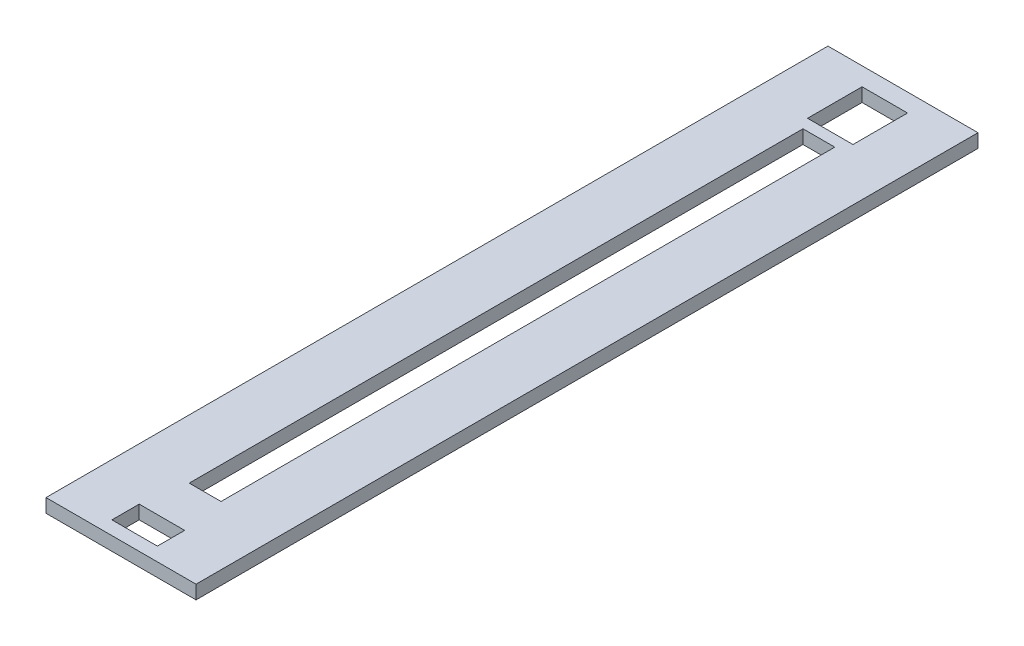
ISO-10303-21;
HEADER;
FILE_DESCRIPTION(('STEP AP214'),'2;1');
FILE_NAME('part.step','',(''),(''),'','','');
FILE_SCHEMA(('AUTOMOTIVE_DESIGN { 1 0 10303 214 1 1 1 1 }'));
ENDSEC;
DATA;
#1=APPLICATION_CONTEXT('core data for automotive mechanical design processes');
#2=APPLICATION_PROTOCOL_DEFINITION('international standard','automotive_design',2000,#1);
#3=PRODUCT_CONTEXT('',#1,'mechanical');
#4=PRODUCT('Part','Part','',(#3));
#5=PRODUCT_RELATED_PRODUCT_CATEGORY('part','',(#4));
#6=PRODUCT_DEFINITION_FORMATION('','',#4);
#7=PRODUCT_DEFINITION_CONTEXT('part definition',#1,'design');
#8=PRODUCT_DEFINITION('design','',#6,#7);
#9=PRODUCT_DEFINITION_SHAPE('','',#8);
#10=(LENGTH_UNIT() NAMED_UNIT(*) SI_UNIT(.MILLI.,.METRE.));
#11=(NAMED_UNIT(*) PLANE_ANGLE_UNIT() SI_UNIT($,.RADIAN.));
#12=(NAMED_UNIT(*) SI_UNIT($,.STERADIAN.) SOLID_ANGLE_UNIT());
#13=UNCERTAINTY_MEASURE_WITH_UNIT(LENGTH_MEASURE(1.E-05),#10,'distance_accuracy_value','');
#14=(GEOMETRIC_REPRESENTATION_CONTEXT(3) GLOBAL_UNCERTAINTY_ASSIGNED_CONTEXT((#13)) GLOBAL_UNIT_ASSIGNED_CONTEXT((#10,
#11,#12)) REPRESENTATION_CONTEXT('',''));
#15=CARTESIAN_POINT('',(0.,0.,0.));
#16=DIRECTION('',(0.,0.,1.));
#17=DIRECTION('',(1.,0.,0.));
#18=AXIS2_PLACEMENT_3D('',#15,#16,#17);
#19=CARTESIAN_POINT('',(0.,3.,0.));
#20=DIRECTION('',(0.,1.,0.));
#21=DIRECTION('',(0.,0.,1.));
#22=AXIS2_PLACEMENT_3D('',#19,#20,#21);
#23=PLANE('',#22);
#24=DIRECTION('',(-1.,0.,0.));
#25=VECTOR('',#24,1.);
#26=CARTESIAN_POINT('',(-3.5,3.,-67.5));
#27=LINE('',#26,#25);
#28=CARTESIAN_POINT('',(3.5,3.,-67.5));
#29=VERTEX_POINT('',#28);
#30=CARTESIAN_POINT('',(-3.5,3.,-67.5));
#31=VERTEX_POINT('',#30);
#32=EDGE_CURVE('E184',#29,#31,#27,.T.);
#33=ORIENTED_EDGE('',*,*,#32,.F.);
#34=DIRECTION('',(0.,0.,-1.));
#35=VECTOR('',#34,1.);
#36=CARTESIAN_POINT('',(3.5,3.,-67.5));
#37=LINE('',#36,#35);
#38=CARTESIAN_POINT('',(3.50000000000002,3.,67.5));
#39=VERTEX_POINT('',#38);
#40=EDGE_CURVE('E182',#39,#29,#37,.T.);
#41=ORIENTED_EDGE('',*,*,#40,.F.);
#42=DIRECTION('',(1.,0.,0.));
#43=VECTOR('',#42,1.);
#44=CARTESIAN_POINT('',(-3.49999999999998,3.,67.5));
#45=LINE('',#44,#43);
#46=CARTESIAN_POINT('',(-3.49999999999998,3.,67.5));
#47=VERTEX_POINT('',#46);
#48=EDGE_CURVE('E190',#47,#39,#45,.T.);
#49=ORIENTED_EDGE('',*,*,#48,.F.);
#50=DIRECTION('',(0.,0.,1.));
#51=VECTOR('',#50,1.);
#52=CARTESIAN_POINT('',(-3.5,3.,-67.5));
#53=LINE('',#52,#51);
#54=EDGE_CURVE('E187',#31,#47,#53,.T.);
#55=ORIENTED_EDGE('',*,*,#54,.F.);
#56=EDGE_LOOP('',(#33,#41,#49,#55));
#57=FACE_BOUND('',#56,.T.);
#58=DIRECTION('',(0.,0.,-1.));
#59=VECTOR('',#58,1.);
#60=CARTESIAN_POINT('',(16.5,3.,-86.));
#61=LINE('',#60,#59);
#62=CARTESIAN_POINT('',(16.5,3.,86.));
#63=VERTEX_POINT('',#62);
#64=CARTESIAN_POINT('',(16.5,3.,-86.));
#65=VERTEX_POINT('',#64);
#66=EDGE_CURVE('E244',#63,#65,#61,.T.);
#67=ORIENTED_EDGE('',*,*,#66,.T.);
#68=DIRECTION('',(-1.,0.,0.));
#69=VECTOR('',#68,1.);
#70=CARTESIAN_POINT('',(-16.5,3.,-86.));
#71=LINE('',#70,#69);
#72=CARTESIAN_POINT('',(-16.5,3.,-86.));
#73=VERTEX_POINT('',#72);
#74=EDGE_CURVE('E247',#65,#73,#71,.T.);
#75=ORIENTED_EDGE('',*,*,#74,.T.);
#76=DIRECTION('',(0.,0.,1.));
#77=VECTOR('',#76,1.);
#78=CARTESIAN_POINT('',(-16.5,3.,-86.));
#79=LINE('',#78,#77);
#80=CARTESIAN_POINT('',(-16.5,3.,86.));
#81=VERTEX_POINT('',#80);
#82=EDGE_CURVE('E250',#73,#81,#79,.T.);
#83=ORIENTED_EDGE('',*,*,#82,.T.);
#84=DIRECTION('',(1.,0.,0.));
#85=VECTOR('',#84,1.);
#86=CARTESIAN_POINT('',(-16.5,3.,86.));
#87=LINE('',#86,#85);
#88=EDGE_CURVE('E252',#81,#63,#87,.T.);
#89=ORIENTED_EDGE('',*,*,#88,.T.);
#90=EDGE_LOOP('',(#67,#75,#83,#89));
#91=FACE_BOUND('',#90,.T.);
#92=DIRECTION('',(-1.,0.,0.));
#93=VECTOR('',#92,1.);
#94=CARTESIAN_POINT('',(-5.00000000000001,3.,-82.));
#95=LINE('',#94,#93);
#96=CARTESIAN_POINT('',(4.99999999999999,3.,-82.));
#97=VERTEX_POINT('',#96);
#98=CARTESIAN_POINT('',(-5.00000000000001,3.,-82.));
#99=VERTEX_POINT('',#98);
#100=EDGE_CURVE('E215',#97,#99,#95,.T.);
#101=ORIENTED_EDGE('',*,*,#100,.F.);
#102=DIRECTION('',(0.,0.,-1.));
#103=VECTOR('',#102,1.);
#104=CARTESIAN_POINT('',(4.99999999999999,3.,-82.));
#105=LINE('',#104,#103);
#106=CARTESIAN_POINT('',(4.99999999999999,3.,-70.));
#107=VERTEX_POINT('',#106);
#108=EDGE_CURVE('E213',#107,#97,#105,.T.);
#109=ORIENTED_EDGE('',*,*,#108,.F.);
#110=DIRECTION('',(1.,0.,0.));
#111=VECTOR('',#110,1.);
#112=CARTESIAN_POINT('',(-5.00000000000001,3.,-70.));
#113=LINE('',#112,#111);
#114=CARTESIAN_POINT('',(-5.00000000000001,3.,-70.));
#115=VERTEX_POINT('',#114);
#116=EDGE_CURVE('E221',#115,#107,#113,.T.);
#117=ORIENTED_EDGE('',*,*,#116,.F.);
#118=DIRECTION('',(0.,0.,1.));
#119=VECTOR('',#118,1.);
#120=CARTESIAN_POINT('',(-5.00000000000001,3.,-82.));
#121=LINE('',#120,#119);
#122=EDGE_CURVE('E218',#99,#115,#121,.T.);
#123=ORIENTED_EDGE('',*,*,#122,.F.);
#124=EDGE_LOOP('',(#101,#109,#117,#123));
#125=FACE_BOUND('',#124,.T.);
#126=DIRECTION('',(-1.,0.,0.));
#127=VECTOR('',#126,1.);
#128=CARTESIAN_POINT('',(-4.99999999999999,3.,76.9999999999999));
#129=LINE('',#128,#127);
#130=CARTESIAN_POINT('',(5.00000000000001,3.,76.9999999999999));
#131=VERTEX_POINT('',#130);
#132=CARTESIAN_POINT('',(-4.99999999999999,3.,76.9999999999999));
#133=VERTEX_POINT('',#132);
#134=EDGE_CURVE('E154',#131,#133,#129,.T.);
#135=ORIENTED_EDGE('',*,*,#134,.F.);
#136=DIRECTION('',(0.,0.,-1.));
#137=VECTOR('',#136,1.);
#138=CARTESIAN_POINT('',(5.00000000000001,3.,76.9999999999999));
#139=LINE('',#138,#137);
#140=CARTESIAN_POINT('',(5.00000000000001,3.,82.9999999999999));
#141=VERTEX_POINT('',#140);
#142=EDGE_CURVE('E146',#141,#131,#139,.T.);
#143=ORIENTED_EDGE('',*,*,#142,.F.);
#144=DIRECTION('',(1.,0.,0.));
#145=VECTOR('',#144,1.);
#146=CARTESIAN_POINT('',(-4.99999999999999,3.,82.9999999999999));
#147=LINE('',#146,#145);
#148=CARTESIAN_POINT('',(-4.99999999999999,3.,82.9999999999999));
#149=VERTEX_POINT('',#148);
#150=EDGE_CURVE('E168',#149,#141,#147,.T.);
#151=ORIENTED_EDGE('',*,*,#150,.F.);
#152=DIRECTION('',(0.,0.,1.));
#153=VECTOR('',#152,1.);
#154=CARTESIAN_POINT('',(-4.99999999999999,3.,76.9999999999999));
#155=LINE('',#154,#153);
#156=EDGE_CURVE('E166',#133,#149,#155,.T.);
#157=ORIENTED_EDGE('',*,*,#156,.F.);
#158=EDGE_LOOP('',(#135,#143,#151,#157));
#159=FACE_BOUND('',#158,.T.);
#160=ADVANCED_FACE('F33',(#57,#91,#125,#159),#23,.T.);
#161=CARTESIAN_POINT('',(0.,0.,0.));
#162=DIRECTION('',(0.,1.,0.));
#163=DIRECTION('',(0.,0.,1.));
#164=AXIS2_PLACEMENT_3D('',#161,#162,#163);
#165=PLANE('',#164);
#166=DIRECTION('',(0.,0.,-1.));
#167=VECTOR('',#166,1.);
#168=CARTESIAN_POINT('',(3.5,0.,-67.5));
#169=LINE('',#168,#167);
#170=CARTESIAN_POINT('',(3.50000000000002,0.,67.5));
#171=VERTEX_POINT('',#170);
#172=CARTESIAN_POINT('',(3.5,0.,-67.5));
#173=VERTEX_POINT('',#172);
#174=EDGE_CURVE('E162',#171,#173,#169,.T.);
#175=ORIENTED_EDGE('',*,*,#174,.T.);
#176=DIRECTION('',(-1.,0.,0.));
#177=VECTOR('',#176,1.);
#178=CARTESIAN_POINT('',(-3.5,0.,-67.5));
#179=LINE('',#178,#177);
#180=CARTESIAN_POINT('',(-3.5,0.,-67.5));
#181=VERTEX_POINT('',#180);
#182=EDGE_CURVE('E195',#173,#181,#179,.T.);
#183=ORIENTED_EDGE('',*,*,#182,.T.);
#184=DIRECTION('',(0.,0.,1.));
#185=VECTOR('',#184,1.);
#186=CARTESIAN_POINT('',(-3.5,0.,-67.5));
#187=LINE('',#186,#185);
#188=CARTESIAN_POINT('',(-3.49999999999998,0.,67.5));
#189=VERTEX_POINT('',#188);
#190=EDGE_CURVE('E198',#181,#189,#187,.T.);
#191=ORIENTED_EDGE('',*,*,#190,.T.);
#192=DIRECTION('',(1.,0.,0.));
#193=VECTOR('',#192,1.);
#194=CARTESIAN_POINT('',(-3.49999999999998,0.,67.5));
#195=LINE('',#194,#193);
#196=EDGE_CURVE('E185',#189,#171,#195,.T.);
#197=ORIENTED_EDGE('',*,*,#196,.T.);
#198=EDGE_LOOP('',(#175,#183,#191,#197));
#199=FACE_BOUND('',#198,.T.);
#200=DIRECTION('',(0.,0.,-1.));
#201=VECTOR('',#200,1.);
#202=CARTESIAN_POINT('',(16.5,0.,-86.));
#203=LINE('',#202,#201);
#204=CARTESIAN_POINT('',(16.5,0.,86.));
#205=VERTEX_POINT('',#204);
#206=CARTESIAN_POINT('',(16.5,0.,-86.));
#207=VERTEX_POINT('',#206);
#208=EDGE_CURVE('E243',#205,#207,#203,.T.);
#209=ORIENTED_EDGE('',*,*,#208,.F.);
#210=DIRECTION('',(1.,0.,0.));
#211=VECTOR('',#210,1.);
#212=CARTESIAN_POINT('',(-16.5,0.,86.));
#213=LINE('',#212,#211);
#214=CARTESIAN_POINT('',(-16.5,0.,86.));
#215=VERTEX_POINT('',#214);
#216=EDGE_CURVE('E248',#215,#205,#213,.T.);
#217=ORIENTED_EDGE('',*,*,#216,.F.);
#218=DIRECTION('',(0.,0.,1.));
#219=VECTOR('',#218,1.);
#220=CARTESIAN_POINT('',(-16.5,0.,-86.));
#221=LINE('',#220,#219);
#222=CARTESIAN_POINT('',(-16.5,0.,-86.));
#223=VERTEX_POINT('',#222);
#224=EDGE_CURVE('E259',#223,#215,#221,.T.);
#225=ORIENTED_EDGE('',*,*,#224,.F.);
#226=DIRECTION('',(-1.,0.,0.));
#227=VECTOR('',#226,1.);
#228=CARTESIAN_POINT('',(-16.5,0.,-86.));
#229=LINE('',#228,#227);
#230=EDGE_CURVE('E257',#207,#223,#229,.T.);
#231=ORIENTED_EDGE('',*,*,#230,.F.);
#232=EDGE_LOOP('',(#209,#217,#225,#231));
#233=FACE_BOUND('',#232,.T.);
#234=DIRECTION('',(0.,0.,-1.));
#235=VECTOR('',#234,1.);
#236=CARTESIAN_POINT('',(4.99999999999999,0.,-82.));
#237=LINE('',#236,#235);
#238=CARTESIAN_POINT('',(4.99999999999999,0.,-70.));
#239=VERTEX_POINT('',#238);
#240=CARTESIAN_POINT('',(4.99999999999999,0.,-82.));
#241=VERTEX_POINT('',#240);
#242=EDGE_CURVE('E212',#239,#241,#237,.T.);
#243=ORIENTED_EDGE('',*,*,#242,.T.);
#244=DIRECTION('',(-1.,0.,0.));
#245=VECTOR('',#244,1.);
#246=CARTESIAN_POINT('',(-5.00000000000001,0.,-82.));
#247=LINE('',#246,#245);
#248=CARTESIAN_POINT('',(-5.00000000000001,0.,-82.));
#249=VERTEX_POINT('',#248);
#250=EDGE_CURVE('E226',#241,#249,#247,.T.);
#251=ORIENTED_EDGE('',*,*,#250,.T.);
#252=DIRECTION('',(0.,0.,1.));
#253=VECTOR('',#252,1.);
#254=CARTESIAN_POINT('',(-5.00000000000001,0.,-82.));
#255=LINE('',#254,#253);
#256=CARTESIAN_POINT('',(-5.00000000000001,0.,-70.));
#257=VERTEX_POINT('',#256);
#258=EDGE_CURVE('E229',#249,#257,#255,.T.);
#259=ORIENTED_EDGE('',*,*,#258,.T.);
#260=DIRECTION('',(1.,0.,0.));
#261=VECTOR('',#260,1.);
#262=CARTESIAN_POINT('',(-5.00000000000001,0.,-70.));
#263=LINE('',#262,#261);
#264=EDGE_CURVE('E216',#257,#239,#263,.T.);
#265=ORIENTED_EDGE('',*,*,#264,.T.);
#266=EDGE_LOOP('',(#243,#251,#259,#265));
#267=FACE_BOUND('',#266,.T.);
#268=DIRECTION('',(0.,0.,-1.));
#269=VECTOR('',#268,1.);
#270=CARTESIAN_POINT('',(5.00000000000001,0.,76.9999999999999));
#271=LINE('',#270,#269);
#272=CARTESIAN_POINT('',(5.00000000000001,0.,82.9999999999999));
#273=VERTEX_POINT('',#272);
#274=CARTESIAN_POINT('',(5.00000000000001,0.,76.9999999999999));
#275=VERTEX_POINT('',#274);
#276=EDGE_CURVE('E56',#273,#275,#271,.T.);
#277=ORIENTED_EDGE('',*,*,#276,.T.);
#278=DIRECTION('',(-1.,0.,0.));
#279=VECTOR('',#278,1.);
#280=CARTESIAN_POINT('',(-4.99999999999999,0.,76.9999999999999));
#281=LINE('',#280,#279);
#282=CARTESIAN_POINT('',(-4.99999999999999,0.,76.9999999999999));
#283=VERTEX_POINT('',#282);
#284=EDGE_CURVE('E161',#275,#283,#281,.T.);
#285=ORIENTED_EDGE('',*,*,#284,.T.);
#286=DIRECTION('',(0.,0.,1.));
#287=VECTOR('',#286,1.);
#288=CARTESIAN_POINT('',(-4.99999999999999,0.,76.9999999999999));
#289=LINE('',#288,#287);
#290=CARTESIAN_POINT('',(-4.99999999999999,0.,82.9999999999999));
#291=VERTEX_POINT('',#290);
#292=EDGE_CURVE('E174',#283,#291,#289,.T.);
#293=ORIENTED_EDGE('',*,*,#292,.T.);
#294=DIRECTION('',(1.,0.,0.));
#295=VECTOR('',#294,1.);
#296=CARTESIAN_POINT('',(-4.99999999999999,0.,82.9999999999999));
#297=LINE('',#296,#295);
#298=EDGE_CURVE('E155',#291,#273,#297,.T.);
#299=ORIENTED_EDGE('',*,*,#298,.T.);
#300=EDGE_LOOP('',(#277,#285,#293,#299));
#301=FACE_BOUND('',#300,.T.);
#302=ADVANCED_FACE('F277',(#199,#233,#267,#301),#165,.F.);
#303=CARTESIAN_POINT('',(16.5,3.,-86.));
#304=DIRECTION('',(-1.,0.,0.));
#305=DIRECTION('',(0.,0.,1.));
#306=AXIS2_PLACEMENT_3D('',#303,#304,#305);
#307=PLANE('',#306);
#308=ORIENTED_EDGE('',*,*,#208,.T.);
#309=DIRECTION('',(0.,-1.,0.));
#310=VECTOR('',#309,1.);
#311=CARTESIAN_POINT('',(16.5,3.,-86.));
#312=LINE('',#311,#310);
#313=EDGE_CURVE('E11',#65,#207,#312,.T.);
#314=ORIENTED_EDGE('',*,*,#313,.F.);
#315=ORIENTED_EDGE('',*,*,#66,.F.);
#316=DIRECTION('',(0.,-1.,0.));
#317=VECTOR('',#316,1.);
#318=CARTESIAN_POINT('',(16.5,3.,86.));
#319=LINE('',#318,#317);
#320=EDGE_CURVE('E254',#63,#205,#319,.T.);
#321=ORIENTED_EDGE('',*,*,#320,.T.);
#322=EDGE_LOOP('',(#308,#314,#315,#321));
#323=FACE_BOUND('',#322,.T.);
#324=ADVANCED_FACE('F35',(#323),#307,.F.);
#325=CARTESIAN_POINT('',(-16.5,3.,-86.));
#326=DIRECTION('',(0.,0.,1.));
#327=DIRECTION('',(1.,0.,0.));
#328=AXIS2_PLACEMENT_3D('',#325,#326,#327);
#329=PLANE('',#328);
#330=ORIENTED_EDGE('',*,*,#230,.T.);
#331=DIRECTION('',(0.,-1.,0.));
#332=VECTOR('',#331,1.);
#333=CARTESIAN_POINT('',(-16.5,3.,-86.));
#334=LINE('',#333,#332);
#335=EDGE_CURVE('E41',#73,#223,#334,.T.);
#336=ORIENTED_EDGE('',*,*,#335,.F.);
#337=ORIENTED_EDGE('',*,*,#74,.F.);
#338=ORIENTED_EDGE('',*,*,#313,.T.);
#339=EDGE_LOOP('',(#330,#336,#337,#338));
#340=FACE_BOUND('',#339,.T.);
#341=ADVANCED_FACE('F288',(#340),#329,.F.);
#342=CARTESIAN_POINT('',(-16.5,3.,-86.));
#343=DIRECTION('',(1.,0.,0.));
#344=DIRECTION('',(0.,0.,-1.));
#345=AXIS2_PLACEMENT_3D('',#342,#343,#344);
#346=PLANE('',#345);
#347=ORIENTED_EDGE('',*,*,#224,.T.);
#348=DIRECTION('',(0.,-1.,0.));
#349=VECTOR('',#348,1.);
#350=CARTESIAN_POINT('',(-16.5,3.,86.));
#351=LINE('',#350,#349);
#352=EDGE_CURVE('E264',#81,#215,#351,.T.);
#353=ORIENTED_EDGE('',*,*,#352,.F.);
#354=ORIENTED_EDGE('',*,*,#82,.F.);
#355=ORIENTED_EDGE('',*,*,#335,.T.);
#356=EDGE_LOOP('',(#347,#353,#354,#355));
#357=FACE_BOUND('',#356,.T.);
#358=ADVANCED_FACE('F271',(#357),#346,.F.);
#359=CARTESIAN_POINT('',(-16.5,3.,86.));
#360=DIRECTION('',(0.,0.,-1.));
#361=DIRECTION('',(-1.,0.,0.));
#362=AXIS2_PLACEMENT_3D('',#359,#360,#361);
#363=PLANE('',#362);
#364=ORIENTED_EDGE('',*,*,#216,.T.);
#365=ORIENTED_EDGE('',*,*,#320,.F.);
#366=ORIENTED_EDGE('',*,*,#88,.F.);
#367=ORIENTED_EDGE('',*,*,#352,.T.);
#368=EDGE_LOOP('',(#364,#365,#366,#367));
#369=FACE_BOUND('',#368,.T.);
#370=ADVANCED_FACE('F281',(#369),#363,.F.);
#371=CARTESIAN_POINT('',(4.99999999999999,3.,-82.));
#372=DIRECTION('',(-1.,0.,0.));
#373=DIRECTION('',(0.,0.,1.));
#374=AXIS2_PLACEMENT_3D('',#371,#372,#373);
#375=PLANE('',#374);
#376=ORIENTED_EDGE('',*,*,#242,.F.);
#377=DIRECTION('',(0.,-1.,0.));
#378=VECTOR('',#377,1.);
#379=CARTESIAN_POINT('',(4.99999999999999,3.,-70.));
#380=LINE('',#379,#378);
#381=EDGE_CURVE('E223',#107,#239,#380,.T.);
#382=ORIENTED_EDGE('',*,*,#381,.F.);
#383=ORIENTED_EDGE('',*,*,#108,.T.);
#384=DIRECTION('',(0.,-1.,0.));
#385=VECTOR('',#384,1.);
#386=CARTESIAN_POINT('',(4.99999999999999,3.,-82.));
#387=LINE('',#386,#385);
#388=EDGE_CURVE('E240',#97,#241,#387,.T.);
#389=ORIENTED_EDGE('',*,*,#388,.T.);
#390=EDGE_LOOP('',(#376,#382,#383,#389));
#391=FACE_BOUND('',#390,.T.);
#392=ADVANCED_FACE('F305',(#391),#375,.T.);
#393=CARTESIAN_POINT('',(-5.00000000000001,3.,-82.));
#394=DIRECTION('',(0.,0.,1.));
#395=DIRECTION('',(1.,0.,0.));
#396=AXIS2_PLACEMENT_3D('',#393,#394,#395);
#397=PLANE('',#396);
#398=ORIENTED_EDGE('',*,*,#250,.F.);
#399=ORIENTED_EDGE('',*,*,#388,.F.);
#400=ORIENTED_EDGE('',*,*,#100,.T.);
#401=DIRECTION('',(0.,-1.,0.));
#402=VECTOR('',#401,1.);
#403=CARTESIAN_POINT('',(-5.00000000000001,3.,-82.));
#404=LINE('',#403,#402);
#405=EDGE_CURVE('E238',#99,#249,#404,.T.);
#406=ORIENTED_EDGE('',*,*,#405,.T.);
#407=EDGE_LOOP('',(#398,#399,#400,#406));
#408=FACE_BOUND('',#407,.T.);
#409=ADVANCED_FACE('F312',(#408),#397,.T.);
#410=CARTESIAN_POINT('',(-5.00000000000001,3.,-82.));
#411=DIRECTION('',(1.,0.,0.));
#412=DIRECTION('',(0.,0.,-1.));
#413=AXIS2_PLACEMENT_3D('',#410,#411,#412);
#414=PLANE('',#413);
#415=ORIENTED_EDGE('',*,*,#258,.F.);
#416=ORIENTED_EDGE('',*,*,#405,.F.);
#417=ORIENTED_EDGE('',*,*,#122,.T.);
#418=DIRECTION('',(0.,-1.,0.));
#419=VECTOR('',#418,1.);
#420=CARTESIAN_POINT('',(-5.00000000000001,3.,-70.));
#421=LINE('',#420,#419);
#422=EDGE_CURVE('E236',#115,#257,#421,.T.);
#423=ORIENTED_EDGE('',*,*,#422,.T.);
#424=EDGE_LOOP('',(#415,#416,#417,#423));
#425=FACE_BOUND('',#424,.T.);
#426=ADVANCED_FACE('F317',(#425),#414,.T.);
#427=CARTESIAN_POINT('',(-5.00000000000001,3.,-70.));
#428=DIRECTION('',(0.,0.,-1.));
#429=DIRECTION('',(-1.,0.,0.));
#430=AXIS2_PLACEMENT_3D('',#427,#428,#429);
#431=PLANE('',#430);
#432=ORIENTED_EDGE('',*,*,#264,.F.);
#433=ORIENTED_EDGE('',*,*,#422,.F.);
#434=ORIENTED_EDGE('',*,*,#116,.T.);
#435=ORIENTED_EDGE('',*,*,#381,.T.);
#436=EDGE_LOOP('',(#432,#433,#434,#435));
#437=FACE_BOUND('',#436,.T.);
#438=ADVANCED_FACE('F324',(#437),#431,.T.);
#439=CARTESIAN_POINT('',(3.5,3.,-67.5));
#440=DIRECTION('',(-1.,0.,0.));
#441=DIRECTION('',(0.,0.,1.));
#442=AXIS2_PLACEMENT_3D('',#439,#440,#441);
#443=PLANE('',#442);
#444=ORIENTED_EDGE('',*,*,#174,.F.);
#445=DIRECTION('',(0.,-1.,0.));
#446=VECTOR('',#445,1.);
#447=CARTESIAN_POINT('',(3.50000000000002,3.,67.5));
#448=LINE('',#447,#446);
#449=EDGE_CURVE('E192',#39,#171,#448,.T.);
#450=ORIENTED_EDGE('',*,*,#449,.F.);
#451=ORIENTED_EDGE('',*,*,#40,.T.);
#452=DIRECTION('',(0.,-1.,0.));
#453=VECTOR('',#452,1.);
#454=CARTESIAN_POINT('',(3.5,3.,-67.5));
#455=LINE('',#454,#453);
#456=EDGE_CURVE('E209',#29,#173,#455,.T.);
#457=ORIENTED_EDGE('',*,*,#456,.T.);
#458=EDGE_LOOP('',(#444,#450,#451,#457));
#459=FACE_BOUND('',#458,.T.);
#460=ADVANCED_FACE('F337',(#459),#443,.T.);
#461=CARTESIAN_POINT('',(-3.5,3.,-67.5));
#462=DIRECTION('',(0.,0.,1.));
#463=DIRECTION('',(1.,0.,0.));
#464=AXIS2_PLACEMENT_3D('',#461,#462,#463);
#465=PLANE('',#464);
#466=ORIENTED_EDGE('',*,*,#182,.F.);
#467=ORIENTED_EDGE('',*,*,#456,.F.);
#468=ORIENTED_EDGE('',*,*,#32,.T.);
#469=DIRECTION('',(0.,-1.,0.));
#470=VECTOR('',#469,1.);
#471=CARTESIAN_POINT('',(-3.5,3.,-67.5));
#472=LINE('',#471,#470);
#473=EDGE_CURVE('E207',#31,#181,#472,.T.);
#474=ORIENTED_EDGE('',*,*,#473,.T.);
#475=EDGE_LOOP('',(#466,#467,#468,#474));
#476=FACE_BOUND('',#475,.T.);
#477=ADVANCED_FACE('F342',(#476),#465,.T.);
#478=CARTESIAN_POINT('',(-3.5,3.,-67.5));
#479=DIRECTION('',(1.,0.,0.));
#480=DIRECTION('',(0.,0.,-1.));
#481=AXIS2_PLACEMENT_3D('',#478,#479,#480);
#482=PLANE('',#481);
#483=ORIENTED_EDGE('',*,*,#190,.F.);
#484=ORIENTED_EDGE('',*,*,#473,.F.);
#485=ORIENTED_EDGE('',*,*,#54,.T.);
#486=DIRECTION('',(0.,-1.,0.));
#487=VECTOR('',#486,1.);
#488=CARTESIAN_POINT('',(-3.49999999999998,3.,67.5));
#489=LINE('',#488,#487);
#490=EDGE_CURVE('E205',#47,#189,#489,.T.);
#491=ORIENTED_EDGE('',*,*,#490,.T.);
#492=EDGE_LOOP('',(#483,#484,#485,#491));
#493=FACE_BOUND('',#492,.T.);
#494=ADVANCED_FACE('F346',(#493),#482,.T.);
#495=CARTESIAN_POINT('',(-3.49999999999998,3.,67.5));
#496=DIRECTION('',(0.,0.,-1.));
#497=DIRECTION('',(-1.,0.,0.));
#498=AXIS2_PLACEMENT_3D('',#495,#496,#497);
#499=PLANE('',#498);
#500=ORIENTED_EDGE('',*,*,#196,.F.);
#501=ORIENTED_EDGE('',*,*,#490,.F.);
#502=ORIENTED_EDGE('',*,*,#48,.T.);
#503=ORIENTED_EDGE('',*,*,#449,.T.);
#504=EDGE_LOOP('',(#500,#501,#502,#503));
#505=FACE_BOUND('',#504,.T.);
#506=ADVANCED_FACE('F350',(#505),#499,.T.);
#507=CARTESIAN_POINT('',(5.00000000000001,3.,76.9999999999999));
#508=DIRECTION('',(-1.,0.,0.));
#509=DIRECTION('',(0.,0.,1.));
#510=AXIS2_PLACEMENT_3D('',#507,#508,#509);
#511=PLANE('',#510);
#512=ORIENTED_EDGE('',*,*,#276,.F.);
#513=DIRECTION('',(0.,-1.,0.));
#514=VECTOR('',#513,1.);
#515=CARTESIAN_POINT('',(5.00000000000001,3.,82.9999999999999));
#516=LINE('',#515,#514);
#517=EDGE_CURVE('E150',#141,#273,#516,.T.);
#518=ORIENTED_EDGE('',*,*,#517,.F.);
#519=ORIENTED_EDGE('',*,*,#142,.T.);
#520=DIRECTION('',(0.,-1.,0.));
#521=VECTOR('',#520,1.);
#522=CARTESIAN_POINT('',(5.00000000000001,3.,76.9999999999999));
#523=LINE('',#522,#521);
#524=EDGE_CURVE('E149',#131,#275,#523,.T.);
#525=ORIENTED_EDGE('',*,*,#524,.T.);
#526=EDGE_LOOP('',(#512,#518,#519,#525));
#527=FACE_BOUND('',#526,.T.);
#528=ADVANCED_FACE('F148',(#527),#511,.T.);
#529=CARTESIAN_POINT('',(-4.99999999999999,3.,76.9999999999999));
#530=DIRECTION('',(0.,0.,1.));
#531=DIRECTION('',(1.,0.,0.));
#532=AXIS2_PLACEMENT_3D('',#529,#530,#531);
#533=PLANE('',#532);
#534=ORIENTED_EDGE('',*,*,#284,.F.);
#535=ORIENTED_EDGE('',*,*,#524,.F.);
#536=ORIENTED_EDGE('',*,*,#134,.T.);
#537=DIRECTION('',(0.,-1.,0.));
#538=VECTOR('',#537,1.);
#539=CARTESIAN_POINT('',(-4.99999999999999,3.,76.9999999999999));
#540=LINE('',#539,#538);
#541=EDGE_CURVE('E163',#133,#283,#540,.T.);
#542=ORIENTED_EDGE('',*,*,#541,.T.);
#543=EDGE_LOOP('',(#534,#535,#536,#542));
#544=FACE_BOUND('',#543,.T.);
#545=ADVANCED_FACE('F158',(#544),#533,.T.);
#546=CARTESIAN_POINT('',(-4.99999999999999,3.,76.9999999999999));
#547=DIRECTION('',(1.,0.,0.));
#548=DIRECTION('',(0.,0.,-1.));
#549=AXIS2_PLACEMENT_3D('',#546,#547,#548);
#550=PLANE('',#549);
#551=ORIENTED_EDGE('',*,*,#292,.F.);
#552=ORIENTED_EDGE('',*,*,#541,.F.);
#553=ORIENTED_EDGE('',*,*,#156,.T.);
#554=DIRECTION('',(0.,-1.,0.));
#555=VECTOR('',#554,1.);
#556=CARTESIAN_POINT('',(-4.99999999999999,3.,82.9999999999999));
#557=LINE('',#556,#555);
#558=EDGE_CURVE('E48',#149,#291,#557,.T.);
#559=ORIENTED_EDGE('',*,*,#558,.T.);
#560=EDGE_LOOP('',(#551,#552,#553,#559));
#561=FACE_BOUND('',#560,.T.);
#562=ADVANCED_FACE('F359',(#561),#550,.T.);
#563=CARTESIAN_POINT('',(-4.99999999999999,3.,82.9999999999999));
#564=DIRECTION('',(0.,0.,-1.));
#565=DIRECTION('',(-1.,0.,0.));
#566=AXIS2_PLACEMENT_3D('',#563,#564,#565);
#567=PLANE('',#566);
#568=ORIENTED_EDGE('',*,*,#298,.F.);
#569=ORIENTED_EDGE('',*,*,#558,.F.);
#570=ORIENTED_EDGE('',*,*,#150,.T.);
#571=ORIENTED_EDGE('',*,*,#517,.T.);
#572=EDGE_LOOP('',(#568,#569,#570,#571));
#573=FACE_BOUND('',#572,.T.);
#574=ADVANCED_FACE('F362',(#573),#567,.T.);
#575=CLOSED_SHELL('',(#160,#302,#324,#341,#358,#370,#392,#409,#426,#438,#460,#477,#494,#506,
#528,#545,#562,#574));
#576=MANIFOLD_SOLID_BREP('B2',#575);
#577=ADVANCED_BREP_SHAPE_REPRESENTATION('',(#18,#576),#14);
#578=SHAPE_DEFINITION_REPRESENTATION(#9,#577);
ENDSEC;
END-ISO-10303-21;
